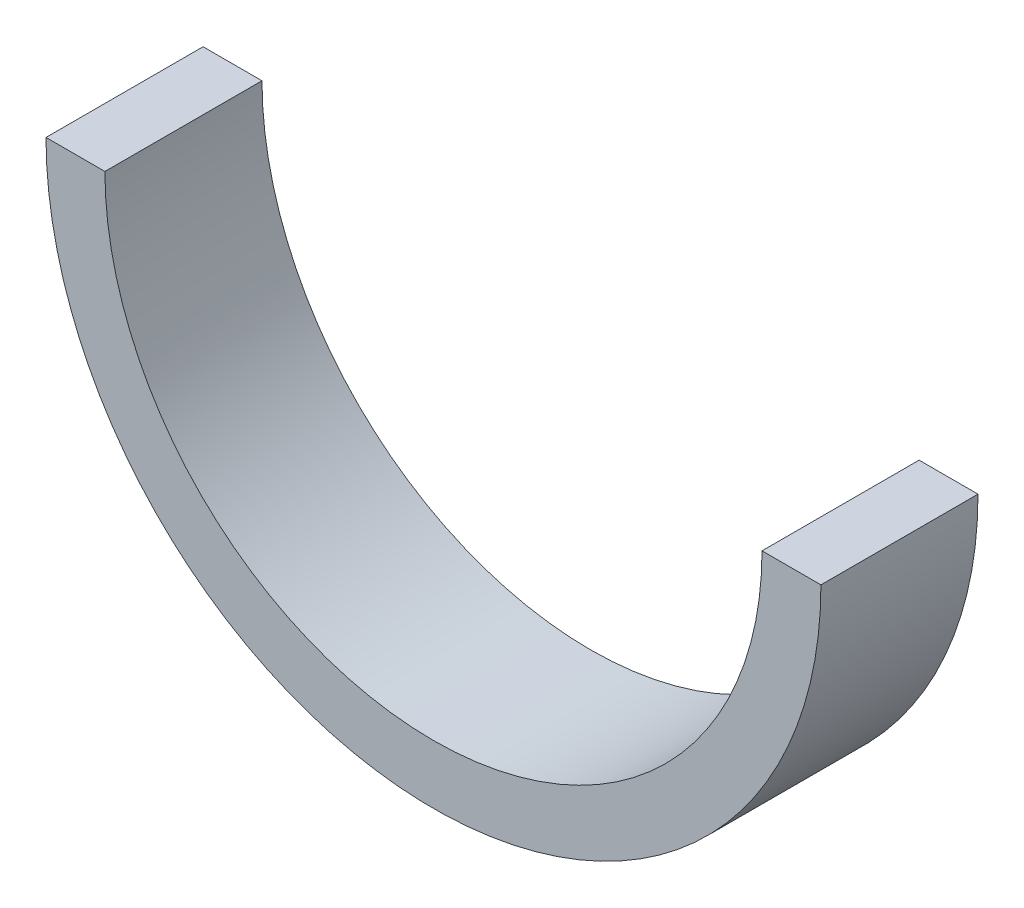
ISO-10303-21;
HEADER;
FILE_DESCRIPTION(('STEP AP214'),'2;1');
FILE_NAME('part.step','',(''),(''),'','','');
FILE_SCHEMA(('AUTOMOTIVE_DESIGN { 1 0 10303 214 1 1 1 1 }'));
ENDSEC;
DATA;
#1=APPLICATION_CONTEXT('core data for automotive mechanical design processes');
#2=APPLICATION_PROTOCOL_DEFINITION('international standard','automotive_design',2000,#1);
#3=PRODUCT_CONTEXT('',#1,'mechanical');
#4=PRODUCT('Part','Part','',(#3));
#5=PRODUCT_RELATED_PRODUCT_CATEGORY('part','',(#4));
#6=PRODUCT_DEFINITION_FORMATION('','',#4);
#7=PRODUCT_DEFINITION_CONTEXT('part definition',#1,'design');
#8=PRODUCT_DEFINITION('design','',#6,#7);
#9=PRODUCT_DEFINITION_SHAPE('','',#8);
#10=(LENGTH_UNIT() NAMED_UNIT(*) SI_UNIT(.MILLI.,.METRE.));
#11=(NAMED_UNIT(*) PLANE_ANGLE_UNIT() SI_UNIT($,.RADIAN.));
#12=(NAMED_UNIT(*) SI_UNIT($,.STERADIAN.) SOLID_ANGLE_UNIT());
#13=UNCERTAINTY_MEASURE_WITH_UNIT(LENGTH_MEASURE(1.E-05),#10,'distance_accuracy_value','');
#14=(GEOMETRIC_REPRESENTATION_CONTEXT(3) GLOBAL_UNCERTAINTY_ASSIGNED_CONTEXT((#13)) GLOBAL_UNIT_ASSIGNED_CONTEXT((#10,
#11,#12)) REPRESENTATION_CONTEXT('',''));
#15=CARTESIAN_POINT('',(0.,0.,0.));
#16=DIRECTION('',(0.,0.,1.));
#17=DIRECTION('',(1.,0.,0.));
#18=AXIS2_PLACEMENT_3D('',#15,#16,#17);
#19=CARTESIAN_POINT('',(0.,0.,0.));
#20=DIRECTION('',(0.,0.,-1.));
#21=DIRECTION('',(-1.,0.,0.));
#22=AXIS2_PLACEMENT_3D('',#19,#20,#21);
#23=CYLINDRICAL_SURFACE('',#22,12.55);
#24=CARTESIAN_POINT('',(0.,0.,0.));
#25=DIRECTION('',(0.,0.,1.));
#26=DIRECTION('',(-1.,0.,0.));
#27=AXIS2_PLACEMENT_3D('',#24,#25,#26);
#28=CIRCLE('',#27,12.55);
#29=CARTESIAN_POINT('',(-12.55,0.,0.));
#30=VERTEX_POINT('',#29);
#31=CARTESIAN_POINT('',(12.55,-3.423379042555E-13,0.));
#32=VERTEX_POINT('',#31);
#33=EDGE_CURVE('E101',#30,#32,#28,.T.);
#34=ORIENTED_EDGE('',*,*,#33,.F.);
#35=DIRECTION('',(0.,0.,1.));
#36=VECTOR('',#35,1.);
#37=CARTESIAN_POINT('',(-12.55,0.,0.));
#38=LINE('',#37,#36);
#39=CARTESIAN_POINT('',(-12.55,0.,6.));
#40=VERTEX_POINT('',#39);
#41=EDGE_CURVE('E10',#30,#40,#38,.T.);
#42=ORIENTED_EDGE('',*,*,#41,.T.);
#43=CARTESIAN_POINT('',(0.,0.,6.));
#44=DIRECTION('',(0.,0.,1.));
#45=DIRECTION('',(-1.,0.,0.));
#46=AXIS2_PLACEMENT_3D('',#43,#44,#45);
#47=CIRCLE('',#46,12.55);
#48=CARTESIAN_POINT('',(12.55,-3.423379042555E-13,6.));
#49=VERTEX_POINT('',#48);
#50=EDGE_CURVE('E25',#40,#49,#47,.T.);
#51=ORIENTED_EDGE('',*,*,#50,.T.);
#52=DIRECTION('',(0.,0.,-1.));
#53=VECTOR('',#52,1.);
#54=CARTESIAN_POINT('',(12.55,0.,0.));
#55=LINE('',#54,#53);
#56=EDGE_CURVE('E71',#49,#32,#55,.T.);
#57=ORIENTED_EDGE('',*,*,#56,.T.);
#58=EDGE_LOOP('',(#34,#42,#51,#57));
#59=FACE_BOUND('',#58,.T.);
#60=ADVANCED_FACE('F16',(#59),#23,.F.);
#61=CARTESIAN_POINT('',(20.,0.,0.));
#62=DIRECTION('',(0.,-1.,0.));
#63=DIRECTION('',(-1.,0.,0.));
#64=AXIS2_PLACEMENT_3D('',#61,#62,#63);
#65=PLANE('',#64);
#66=DIRECTION('',(0.,0.,1.));
#67=VECTOR('',#66,1.);
#68=CARTESIAN_POINT('',(-14.8,0.,0.));
#69=LINE('',#68,#67);
#70=CARTESIAN_POINT('',(-14.8,0.,0.));
#71=VERTEX_POINT('',#70);
#72=CARTESIAN_POINT('',(-14.8,0.,6.));
#73=VERTEX_POINT('',#72);
#74=EDGE_CURVE('E84',#71,#73,#69,.T.);
#75=ORIENTED_EDGE('',*,*,#74,.T.);
#76=DIRECTION('',(-1.,0.,0.));
#77=VECTOR('',#76,1.);
#78=CARTESIAN_POINT('',(20.,0.,6.));
#79=LINE('',#78,#77);
#80=EDGE_CURVE('E79',#40,#73,#79,.T.);
#81=ORIENTED_EDGE('',*,*,#80,.F.);
#82=ORIENTED_EDGE('',*,*,#41,.F.);
#83=DIRECTION('',(-1.,0.,0.));
#84=VECTOR('',#83,1.);
#85=CARTESIAN_POINT('',(20.,0.,0.));
#86=LINE('',#85,#84);
#87=EDGE_CURVE('E74',#30,#71,#86,.T.);
#88=ORIENTED_EDGE('',*,*,#87,.T.);
#89=EDGE_LOOP('',(#75,#81,#82,#88));
#90=FACE_BOUND('',#89,.T.);
#91=ADVANCED_FACE('F116',(#90),#65,.F.);
#92=CARTESIAN_POINT('',(0.,0.,6.));
#93=DIRECTION('',(0.,0.,1.));
#94=DIRECTION('',(1.,0.,0.));
#95=AXIS2_PLACEMENT_3D('',#92,#93,#94);
#96=PLANE('',#95);
#97=ORIENTED_EDGE('',*,*,#80,.T.);
#98=CARTESIAN_POINT('',(0.,0.,6.));
#99=DIRECTION('',(0.,0.,1.));
#100=DIRECTION('',(-1.,0.,0.));
#101=AXIS2_PLACEMENT_3D('',#98,#99,#100);
#102=CIRCLE('',#101,14.8);
#103=CARTESIAN_POINT('',(14.8,3.390523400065E-13,6.));
#104=VERTEX_POINT('',#103);
#105=EDGE_CURVE('E80',#73,#104,#102,.T.);
#106=ORIENTED_EDGE('',*,*,#105,.T.);
#107=DIRECTION('',(-1.,0.,0.));
#108=VECTOR('',#107,1.);
#109=CARTESIAN_POINT('',(20.,0.,6.));
#110=LINE('',#109,#108);
#111=EDGE_CURVE('E19',#104,#49,#110,.T.);
#112=ORIENTED_EDGE('',*,*,#111,.T.);
#113=ORIENTED_EDGE('',*,*,#50,.F.);
#114=EDGE_LOOP('',(#97,#106,#112,#113));
#115=FACE_BOUND('',#114,.T.);
#116=ADVANCED_FACE('F77',(#115),#96,.T.);
#117=CARTESIAN_POINT('',(20.,0.,0.));
#118=DIRECTION('',(0.,-1.,0.));
#119=DIRECTION('',(-1.,0.,0.));
#120=AXIS2_PLACEMENT_3D('',#117,#118,#119);
#121=PLANE('',#120);
#122=ORIENTED_EDGE('',*,*,#111,.F.);
#123=DIRECTION('',(0.,0.,-1.));
#124=VECTOR('',#123,1.);
#125=CARTESIAN_POINT('',(14.8,0.,0.));
#126=LINE('',#125,#124);
#127=CARTESIAN_POINT('',(14.8,3.390523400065E-13,0.));
#128=VERTEX_POINT('',#127);
#129=EDGE_CURVE('E75',#104,#128,#126,.T.);
#130=ORIENTED_EDGE('',*,*,#129,.T.);
#131=DIRECTION('',(-1.,0.,0.));
#132=VECTOR('',#131,1.);
#133=CARTESIAN_POINT('',(20.,0.,0.));
#134=LINE('',#133,#132);
#135=EDGE_CURVE('E104',#128,#32,#134,.T.);
#136=ORIENTED_EDGE('',*,*,#135,.T.);
#137=ORIENTED_EDGE('',*,*,#56,.F.);
#138=EDGE_LOOP('',(#122,#130,#136,#137));
#139=FACE_BOUND('',#138,.T.);
#140=ADVANCED_FACE('F69',(#139),#121,.F.);
#141=CARTESIAN_POINT('',(0.,0.,0.));
#142=DIRECTION('',(0.,0.,1.));
#143=DIRECTION('',(1.,0.,0.));
#144=AXIS2_PLACEMENT_3D('',#141,#142,#143);
#145=PLANE('',#144);
#146=ORIENTED_EDGE('',*,*,#33,.T.);
#147=ORIENTED_EDGE('',*,*,#135,.F.);
#148=CARTESIAN_POINT('',(0.,0.,0.));
#149=DIRECTION('',(0.,0.,1.));
#150=DIRECTION('',(-1.,0.,0.));
#151=AXIS2_PLACEMENT_3D('',#148,#149,#150);
#152=CIRCLE('',#151,14.8);
#153=EDGE_CURVE('E89',#71,#128,#152,.T.);
#154=ORIENTED_EDGE('',*,*,#153,.F.);
#155=ORIENTED_EDGE('',*,*,#87,.F.);
#156=EDGE_LOOP('',(#146,#147,#154,#155));
#157=FACE_BOUND('',#156,.T.);
#158=ADVANCED_FACE('F119',(#157),#145,.F.);
#159=CARTESIAN_POINT('',(0.,0.,0.));
#160=DIRECTION('',(0.,0.,-1.));
#161=DIRECTION('',(-1.,0.,0.));
#162=AXIS2_PLACEMENT_3D('',#159,#160,#161);
#163=CYLINDRICAL_SURFACE('',#162,14.8);
#164=ORIENTED_EDGE('',*,*,#129,.F.);
#165=ORIENTED_EDGE('',*,*,#105,.F.);
#166=ORIENTED_EDGE('',*,*,#74,.F.);
#167=ORIENTED_EDGE('',*,*,#153,.T.);
#168=EDGE_LOOP('',(#164,#165,#166,#167));
#169=FACE_BOUND('',#168,.T.);
#170=ADVANCED_FACE('F86',(#169),#163,.T.);
#171=CLOSED_SHELL('',(#60,#91,#116,#140,#158,#170));
#172=MANIFOLD_SOLID_BREP('B1',#171);
#173=ADVANCED_BREP_SHAPE_REPRESENTATION('',(#18,#172),#14);
#174=SHAPE_DEFINITION_REPRESENTATION(#9,#173);
ENDSEC;
END-ISO-10303-21;
